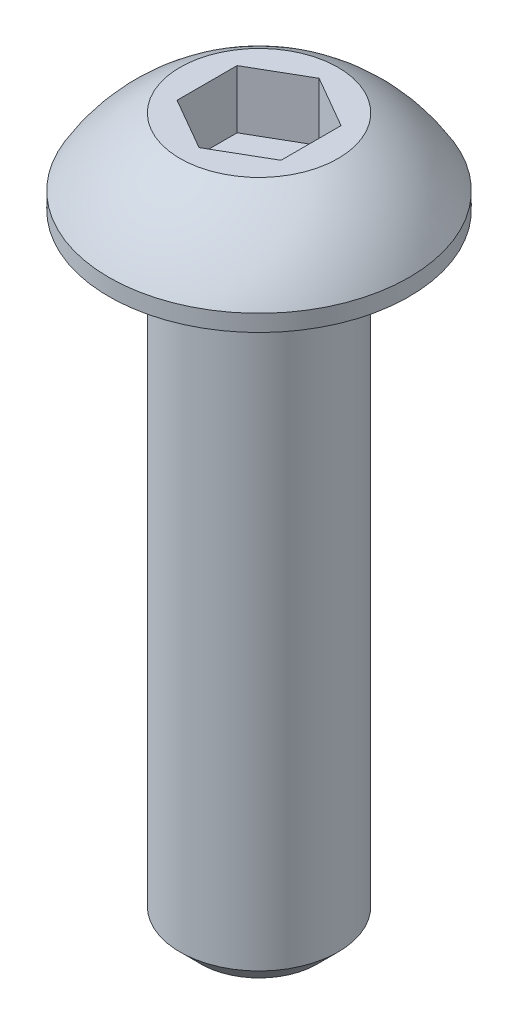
ISO-10303-21;
HEADER;
FILE_DESCRIPTION(('STEP AP214'),'2;1');
FILE_NAME('part.step','',(''),(''),'','','');
FILE_SCHEMA(('AUTOMOTIVE_DESIGN { 1 0 10303 214 1 1 1 1 }'));
ENDSEC;
DATA;
#1=APPLICATION_CONTEXT('core data for automotive mechanical design processes');
#2=APPLICATION_PROTOCOL_DEFINITION('international standard','automotive_design',2000,#1);
#3=PRODUCT_CONTEXT('',#1,'mechanical');
#4=PRODUCT('Part','Part','',(#3));
#5=PRODUCT_RELATED_PRODUCT_CATEGORY('part','',(#4));
#6=PRODUCT_DEFINITION_FORMATION('','',#4);
#7=PRODUCT_DEFINITION_CONTEXT('part definition',#1,'design');
#8=PRODUCT_DEFINITION('design','',#6,#7);
#9=PRODUCT_DEFINITION_SHAPE('','',#8);
#10=(LENGTH_UNIT() NAMED_UNIT(*) SI_UNIT(.MILLI.,.METRE.));
#11=(NAMED_UNIT(*) PLANE_ANGLE_UNIT() SI_UNIT($,.RADIAN.));
#12=(NAMED_UNIT(*) SI_UNIT($,.STERADIAN.) SOLID_ANGLE_UNIT());
#13=UNCERTAINTY_MEASURE_WITH_UNIT(LENGTH_MEASURE(1.E-05),#10,'distance_accuracy_value','');
#14=(GEOMETRIC_REPRESENTATION_CONTEXT(3) GLOBAL_UNCERTAINTY_ASSIGNED_CONTEXT((#13)) GLOBAL_UNIT_ASSIGNED_CONTEXT((#10,
#11,#12)) REPRESENTATION_CONTEXT('',''));
#15=CARTESIAN_POINT('',(0.,0.,0.));
#16=DIRECTION('',(0.,0.,1.));
#17=DIRECTION('',(1.,0.,0.));
#18=AXIS2_PLACEMENT_3D('',#15,#16,#17);
#19=CARTESIAN_POINT('',(0.,0.,0.));
#20=DIRECTION('',(0.,-1.00000000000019,0.));
#21=DIRECTION('',(0.,0.,-0.999999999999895));
#22=AXIS2_PLACEMENT_3D('',#19,#20,#21);
#23=PLANE('',#22);
#24=CARTESIAN_POINT('',(0.,0.,0.));
#25=DIRECTION('',(0.,-1.00000000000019,0.));
#26=DIRECTION('',(0.,0.,-0.999999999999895));
#27=AXIS2_PLACEMENT_3D('',#24,#25,#26);
#28=CIRCLE('',#27,2.413);
#29=CARTESIAN_POINT('',(0.,0.,-2.41299999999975));
#30=VERTEX_POINT('',#29);
#31=EDGE_CURVE('E11',#30,#30,#28,.T.);
#32=ORIENTED_EDGE('',*,*,#31,.F.);
#33=EDGE_LOOP('',(#32));
#34=FACE_BOUND('',#33,.T.);
#35=CARTESIAN_POINT('',(0.,0.,0.));
#36=DIRECTION('',(0.,-1.00000000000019,0.));
#37=DIRECTION('',(0.,0.,-0.999999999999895));
#38=AXIS2_PLACEMENT_3D('',#35,#36,#37);
#39=CIRCLE('',#38,4.5847);
#40=CARTESIAN_POINT('',(0.,0.,-4.58469999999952));
#41=VERTEX_POINT('',#40);
#42=EDGE_CURVE('E45',#41,#41,#39,.T.);
#43=ORIENTED_EDGE('',*,*,#42,.T.);
#44=EDGE_LOOP('',(#43));
#45=FACE_BOUND('',#44,.T.);
#46=ADVANCED_FACE('F38',(#34,#45),#23,.T.);
#47=CARTESIAN_POINT('',(0.,0.,0.));
#48=DIRECTION('',(0.,-1.00000000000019,0.));
#49=DIRECTION('',(0.,0.,-0.999999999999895));
#50=AXIS2_PLACEMENT_3D('',#47,#48,#49);
#51=CYLINDRICAL_SURFACE('',#50,4.5847);
#52=CARTESIAN_POINT('',(-1.9151347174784E-12,0.50800000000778,0.));
#53=DIRECTION('',(0.,-1.00000000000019,0.));
#54=DIRECTION('',(0.,0.,-0.999999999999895));
#55=AXIS2_PLACEMENT_3D('',#52,#53,#54);
#56=CIRCLE('',#55,4.5847);
#57=CARTESIAN_POINT('',(4.58470000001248,0.50800000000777,-2.55197145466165E-13));
#58=VERTEX_POINT('',#57);
#59=EDGE_CURVE('E155',#58,#58,#56,.T.);
#60=ORIENTED_EDGE('',*,*,#59,.T.);
#61=EDGE_LOOP('',(#60));
#62=FACE_BOUND('',#61,.T.);
#63=ORIENTED_EDGE('',*,*,#42,.F.);
#64=EDGE_LOOP('',(#63));
#65=FACE_BOUND('',#64,.T.);
#66=ADVANCED_FACE('F161',(#62,#65),#51,.T.);
#67=CARTESIAN_POINT('',(1.27398092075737E-11,-2.15653055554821,-1.38777878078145E-13));
#68=DIRECTION('',(0.,-1.00000000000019,0.));
#69=DIRECTION('',(0.99999999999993,0.,0.));
#70=AXIS2_PLACEMENT_3D('',#67,#68,#69);
#71=SPHERICAL_SURFACE('',#70,5.30275373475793);
#72=CARTESIAN_POINT('',(1.02418074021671E-11,2.56540000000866,2.77555756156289E-13));
#73=DIRECTION('',(0.,-1.00000000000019,0.));
#74=DIRECTION('',(0.,0.,-0.999999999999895));
#75=AXIS2_PLACEMENT_3D('',#72,#73,#74);
#76=CIRCLE('',#75,2.413);
#77=CARTESIAN_POINT('',(2.41300000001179,2.56540000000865,-2.19031174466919E-13));
#78=VERTEX_POINT('',#77);
#79=EDGE_CURVE('E152',#78,#78,#76,.T.);
#80=CARTESIAN_POINT('',(2.41300000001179,2.56540000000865,-2.19031174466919E-13));
#81=CARTESIAN_POINT('',(2.44113024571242,2.55102492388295,-2.19569817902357E-13));
#82=CARTESIAN_POINT('',(2.46913200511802,2.53639841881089,-2.20104188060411E-13));
#83=CARTESIAN_POINT('',(2.52486967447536,2.50664734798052,-2.21164213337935E-13));
#84=CARTESIAN_POINT('',(2.55260558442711,2.49152278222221,-2.21689868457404E-13));
#85=CARTESIAN_POINT('',(2.60780267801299,2.46078038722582,-2.22732295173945E-13));
#86=CARTESIAN_POINT('',(2.63526386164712,2.44516255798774,-2.23249066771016E-13));
#87=CARTESIAN_POINT('',(2.68990273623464,2.41343863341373,-2.24273561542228E-13));
#88=CARTESIAN_POINT('',(2.71708042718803,2.3973325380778,-2.24781284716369E-13));
#89=CARTESIAN_POINT('',(2.77114363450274,2.36463722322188,-2.25787520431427E-13));
#90=CARTESIAN_POINT('',(2.79802915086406,2.34804800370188,-2.26286032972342E-13));
#91=CARTESIAN_POINT('',(2.85149942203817,2.3143917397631,-2.27273688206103E-13));
#92=CARTESIAN_POINT('',(2.87808417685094,2.2973246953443,-2.27762830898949E-13));
#93=CARTESIAN_POINT('',(2.93094443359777,2.26271823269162,-2.28731590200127E-13));
#94=CARTESIAN_POINT('',(2.95721993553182,2.24517881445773,-2.29211206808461E-13));
#95=CARTESIAN_POINT('',(3.00945329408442,2.20963320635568,-2.30160760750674E-13));
#96=CARTESIAN_POINT('',(3.03541115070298,2.19162701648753,-2.30630698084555E-13));
#97=CARTESIAN_POINT('',(3.08700092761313,2.15515361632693,-2.31560743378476E-13));
#98=CARTESIAN_POINT('',(3.11263284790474,2.13668640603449,-2.32020851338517E-13));
#99=CARTESIAN_POINT('',(3.16356256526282,2.09929686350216,-2.32931090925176E-13));
#100=CARTESIAN_POINT('',(3.1888603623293,2.08037453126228,-2.33381222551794E-13));
#101=CARTESIAN_POINT('',(3.23911375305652,2.04208078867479,-2.34271365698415E-13));
#102=CARTESIAN_POINT('',(3.26406934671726,2.02270937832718,-2.34711377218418E-13));
#103=CARTESIAN_POINT('',(3.31363035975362,1.98352366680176,-2.35581139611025E-13));
#104=CARTESIAN_POINT('',(3.33823577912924,1.96370936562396,-2.36010890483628E-13));
#105=CARTESIAN_POINT('',(3.38708858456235,1.92364420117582,-2.36859994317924E-13));
#106=CARTESIAN_POINT('',(3.41133597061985,1.90339333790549,-2.37279347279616E-13));
#107=CARTESIAN_POINT('',(3.45946496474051,1.86246151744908,-2.38107521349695E-13));
#108=CARTESIAN_POINT('',(3.48334657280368,1.84178056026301,-2.38516342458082E-13));
#109=CARTESIAN_POINT('',(3.53073638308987,1.79999515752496,-2.39323322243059E-13));
#110=CARTESIAN_POINT('',(3.5542445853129,1.77889071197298,-2.39721480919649E-13));
#111=CARTESIAN_POINT('',(3.60088007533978,1.73626507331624,-2.40507008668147E-13));
#112=CARTESIAN_POINT('',(3.62400736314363,1.71474388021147,-2.40894377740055E-13));
#113=CARTESIAN_POINT('',(3.66987363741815,1.67129162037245,-2.41658202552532E-13));
#114=CARTESIAN_POINT('',(3.69261262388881,1.64936055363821,-2.420346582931E-13));
#115=CARTESIAN_POINT('',(3.73769503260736,1.60509555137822,-2.42776536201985E-13));
#116=CARTESIAN_POINT('',(3.76003845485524,1.58276161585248,-2.43141958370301E-13));
#117=CARTESIAN_POINT('',(3.80432259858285,1.53769800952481,-2.43861652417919E-13));
#118=CARTESIAN_POINT('',(3.82626332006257,1.51496833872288,-2.44215924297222E-13));
#119=CARTESIAN_POINT('',(3.86973505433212,1.46912052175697,-2.44913204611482E-13));
#120=CARTESIAN_POINT('',(3.89126606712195,1.44600237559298,-2.4525621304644E-13));
#121=CARTESIAN_POINT('',(3.93391150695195,1.39938499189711,-2.45930856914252E-13));
#122=CARTESIAN_POINT('',(3.95502593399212,1.37588575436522,-2.46262492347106E-13));
#123=CARTESIAN_POINT('',(3.99683145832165,1.32851369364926,-2.46914284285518E-13));
#124=CARTESIAN_POINT('',(4.01752255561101,1.30464087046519,-2.47234440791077E-13));
#125=CARTESIAN_POINT('',(4.05847481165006,1.25652926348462,-2.47863172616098E-13));
#126=CARTESIAN_POINT('',(4.07873597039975,1.23229047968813,-2.48171747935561E-13));
#127=CARTESIAN_POINT('',(4.11882187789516,1.18345469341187,-2.48777218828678E-13));
#128=CARTESIAN_POINT('',(4.13864662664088,1.15885769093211,-2.49074114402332E-13));
#129=CARTESIAN_POINT('',(4.17785338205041,1.10931332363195,-2.49656130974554E-13));
#130=CARTESIAN_POINT('',(4.19723538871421,1.08436595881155,-2.49941251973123E-13));
#131=CARTESIAN_POINT('',(4.23555046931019,1.03412883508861,-2.50499628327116E-13));
#132=CARTESIAN_POINT('',(4.25448354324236,1.00883907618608,-2.50772883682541E-13));
#133=CARTESIAN_POINT('',(4.29189471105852,0.957925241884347,-2.5130744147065E-13));
#134=CARTESIAN_POINT('',(4.3103728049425,0.932301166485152,-2.51568743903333E-13));
#135=CARTESIAN_POINT('',(4.34686811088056,0.880726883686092,-2.52079312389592E-13));
#136=CARTESIAN_POINT('',(4.36488532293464,0.854776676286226,-2.52328578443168E-13));
#137=CARTESIAN_POINT('',(4.40045310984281,0.802558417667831,-2.52814994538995E-13));
#138=CARTESIAN_POINT('',(4.4180036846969,0.776290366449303,-2.53052144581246E-13));
#139=CARTESIAN_POINT('',(4.45263259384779,0.723444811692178,-2.5351425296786E-13));
#140=CARTESIAN_POINT('',(4.46971092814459,0.69686730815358,-2.53739211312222E-13));
#141=CARTESIAN_POINT('',(4.50338989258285,0.643411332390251,-2.54176864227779E-13));
#142=CARTESIAN_POINT('',(4.51999052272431,0.616532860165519,-2.54389558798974E-13));
#143=CARTESIAN_POINT('',(4.55270880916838,0.562483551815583,-2.54802617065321E-13));
#144=CARTESIAN_POINT('',(4.56882646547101,0.535312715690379,-2.55002980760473E-13));
#145=CARTESIAN_POINT('',(4.58470000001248,0.50800000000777,-2.55197145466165E-13));
#146=B_SPLINE_CURVE_WITH_KNOTS('',3,(#80,#81,#82,#83,#84,#85,#86,#87,#88,#89,#90,#91,#92,#93,
#94,#95,#96,#97,#98,#99,#100,#101,#102,#103,#104,#105,#106,#107,#108,#109,#110,#111,#112,#113,
#114,#115,#116,#117,#118,#119,#120,#121,#122,#123,#124,#125,#126,#127,#128,#129,#130,#131,#132,
#133,#134,#135,#136,#137,#138,#139,#140,#141,#142,#143,#144,#145),.UNSPECIFIED.,.F.,.F.,(4,2,2,
2,2,2,2,2,2,2,2,2,2,2,2,2,2,2,2,2,2,2,2,2,2,2,2,2,2,2,2,2,4),(0.,0.094769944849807,
0.189539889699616,0.284309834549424,0.379079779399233,0.473849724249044,0.568619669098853,
0.663389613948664,0.758159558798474,0.852929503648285,0.947699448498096,1.04246939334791,
1.13723933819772,1.23200928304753,1.32677922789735,1.42154917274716,1.51631911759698,
1.61108906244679,1.7058590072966,1.80062895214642,1.89539889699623,1.99016884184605,
2.08493878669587,2.17970873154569,2.2744786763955,2.36924862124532,2.46401856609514,
2.55878851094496,2.65355845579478,2.7483284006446,2.84309834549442,2.93786829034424,
3.03263823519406),.UNSPECIFIED.);
#147=EDGE_CURVE('BSEAM163',#78,#58,#146,.T.);
#148=ORIENTED_EDGE('',*,*,#79,.T.);
#149=ORIENTED_EDGE('',*,*,#59,.F.);
#150=ORIENTED_EDGE('',*,*,#147,.T.);
#151=ORIENTED_EDGE('',*,*,#147,.F.);
#152=EDGE_LOOP('',(#148,#150,#149,#151));
#153=FACE_BOUND('',#152,.T.);
#154=ADVANCED_FACE('F163',(#153),#71,.T.);
#155=CARTESIAN_POINT('',(2.41300000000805,2.5654000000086,-3.33066907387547E-13));
#156=DIRECTION('',(0.,1.00000000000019,0.));
#157=DIRECTION('',(0.,0.,0.999999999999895));
#158=AXIS2_PLACEMENT_3D('',#155,#156,#157);
#159=PLANE('',#158);
#160=DIRECTION('',(1.0185706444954E-11,0.,0.999999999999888));
#161=VECTOR('',#160,1.);
#162=CARTESIAN_POINT('',(-1.58750000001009,2.56540000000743,-0.916543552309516));
#163=LINE('',#162,#161);
#164=CARTESIAN_POINT('',(-1.58750000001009,2.56540000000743,-0.916543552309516));
#165=VERTEX_POINT('',#164);
#166=CARTESIAN_POINT('',(-1.58749999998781,2.56540000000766,0.916543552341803));
#167=VERTEX_POINT('',#166);
#168=EDGE_CURVE('E52',#165,#167,#163,.T.);
#169=ORIENTED_EDGE('',*,*,#168,.F.);
#170=DIRECTION('',(-0.866025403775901,0.,0.500000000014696));
#171=VECTOR('',#170,1.);
#172=CARTESIAN_POINT('',(-1.78190795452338E-11,2.56540000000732,-1.83308710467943));
#173=LINE('',#172,#171);
#174=CARTESIAN_POINT('',(-1.78190795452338E-11,2.56540000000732,-1.83308710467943));
#175=VERTEX_POINT('',#174);
#176=EDGE_CURVE('E122',#175,#165,#173,.T.);
#177=ORIENTED_EDGE('',*,*,#176,.F.);
#178=DIRECTION('',(-0.866025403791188,0.,-0.499999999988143));
#179=VECTOR('',#178,1.);
#180=CARTESIAN_POINT('',(1.58749999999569,2.56540000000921,-0.916543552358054));
#181=LINE('',#180,#179);
#182=CARTESIAN_POINT('',(1.58749999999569,2.56540000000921,-0.916543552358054));
#183=VERTEX_POINT('',#182);
#184=EDGE_CURVE('E116',#183,#175,#181,.T.);
#185=ORIENTED_EDGE('',*,*,#184,.F.);
#186=DIRECTION('',(-1.01854835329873E-11,0.,-0.999999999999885));
#187=VECTOR('',#186,1.);
#188=CARTESIAN_POINT('',(1.58750000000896,2.56540000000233,0.916543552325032));
#189=LINE('',#188,#187);
#190=CARTESIAN_POINT('',(1.58750000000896,2.56540000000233,0.916543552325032));
#191=VERTEX_POINT('',#190);
#192=EDGE_CURVE('E114',#191,#183,#189,.T.);
#193=ORIENTED_EDGE('',*,*,#192,.F.);
#194=DIRECTION('',(0.866025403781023,0.,-0.500000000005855));
#195=VECTOR('',#194,1.);
#196=CARTESIAN_POINT('',(9.04831765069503E-12,2.56540000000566,1.83308710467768));
#197=LINE('',#196,#195);
#198=CARTESIAN_POINT('',(9.04831765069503E-12,2.56540000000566,1.83308710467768));
#199=VERTEX_POINT('',#198);
#200=EDGE_CURVE('E95',#199,#191,#197,.T.);
#201=ORIENTED_EDGE('',*,*,#200,.F.);
#202=DIRECTION('',(0.866025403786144,0.,0.49999999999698));
#203=VECTOR('',#202,1.);
#204=CARTESIAN_POINT('',(-1.58749999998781,2.56540000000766,0.916543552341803));
#205=LINE('',#204,#203);
#206=EDGE_CURVE('E106',#167,#199,#205,.T.);
#207=ORIENTED_EDGE('',*,*,#206,.F.);
#208=EDGE_LOOP('',(#169,#177,#185,#193,#201,#207));
#209=FACE_BOUND('',#208,.T.);
#210=ORIENTED_EDGE('',*,*,#79,.F.);
#211=EDGE_LOOP('',(#210));
#212=FACE_BOUND('',#211,.T.);
#213=ADVANCED_FACE('F110',(#209,#212),#159,.T.);
#214=CARTESIAN_POINT('',(4.9960036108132E-12,-19.0499999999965,0.));
#215=DIRECTION('',(0.,-1.00000000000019,0.));
#216=DIRECTION('',(0.,0.,-0.999999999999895));
#217=AXIS2_PLACEMENT_3D('',#214,#215,#216);
#218=PLANE('',#217);
#219=CARTESIAN_POINT('',(4.9960036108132E-12,-19.0499999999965,0.));
#220=DIRECTION('',(0.,-1.00000000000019,0.));
#221=DIRECTION('',(0.,0.,-0.999999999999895));
#222=AXIS2_PLACEMENT_3D('',#219,#220,#221);
#223=CIRCLE('',#222,1.78308);
#224=CARTESIAN_POINT('',(5.03370138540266E-12,-19.0499999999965,-1.78307999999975));
#225=VERTEX_POINT('',#224);
#226=EDGE_CURVE('E149',#225,#225,#223,.T.);
#227=ORIENTED_EDGE('',*,*,#226,.T.);
#228=EDGE_LOOP('',(#227));
#229=FACE_BOUND('',#228,.T.);
#230=ADVANCED_FACE('F175',(#229),#218,.T.);
#231=CARTESIAN_POINT('',(4.9960036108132E-12,-19.0499999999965,0.));
#232=DIRECTION('',(0.,1.00000000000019,0.));
#233=DIRECTION('',(0.,0.,0.999999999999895));
#234=AXIS2_PLACEMENT_3D('',#231,#232,#233);
#235=CONICAL_SURFACE('',#234,1.78308,0.785398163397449);
#236=CARTESIAN_POINT('',(6.02295990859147E-12,-18.4200799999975,0.));
#237=DIRECTION('',(0.,-1.00000000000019,0.));
#238=DIRECTION('',(0.,0.,-0.999999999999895));
#239=AXIS2_PLACEMENT_3D('',#236,#237,#238);
#240=CIRCLE('',#239,2.413);
#241=CARTESIAN_POINT('',(6.07397541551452E-12,-18.4200799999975,-2.41299999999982));
#242=VERTEX_POINT('',#241);
#243=EDGE_CURVE('E140',#242,#242,#240,.T.);
#244=ORIENTED_EDGE('',*,*,#243,.T.);
#245=EDGE_LOOP('',(#244));
#246=FACE_BOUND('',#245,.T.);
#247=ORIENTED_EDGE('',*,*,#226,.F.);
#248=EDGE_LOOP('',(#247));
#249=FACE_BOUND('',#248,.T.);
#250=ADVANCED_FACE('F178',(#246,#249),#235,.T.);
#251=CARTESIAN_POINT('',(0.,0.,0.));
#252=DIRECTION('',(0.,-1.00000000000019,0.));
#253=DIRECTION('',(0.,0.,-0.999999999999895));
#254=AXIS2_PLACEMENT_3D('',#251,#252,#253);
#255=CYLINDRICAL_SURFACE('',#254,2.413);
#256=ORIENTED_EDGE('',*,*,#31,.T.);
#257=EDGE_LOOP('',(#256));
#258=FACE_BOUND('',#257,.T.);
#259=ORIENTED_EDGE('',*,*,#243,.F.);
#260=EDGE_LOOP('',(#259));
#261=FACE_BOUND('',#260,.T.);
#262=ADVANCED_FACE('F182',(#258,#261),#255,.T.);
#263=CARTESIAN_POINT('',(-1.5875000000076,0.787400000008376,-0.916543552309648));
#264=DIRECTION('',(-0.999999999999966,0.,1.02291265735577E-11));
#265=DIRECTION('',(1.0185706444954E-11,0.,0.999999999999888));
#266=AXIS2_PLACEMENT_3D('',#263,#264,#265);
#267=PLANE('',#266);
#268=ORIENTED_EDGE('',*,*,#168,.T.);
#269=DIRECTION('',(0.,1.00000000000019,0.));
#270=VECTOR('',#269,1.);
#271=CARTESIAN_POINT('',(-1.58749999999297,0.787400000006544,0.91654355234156));
#272=LINE('',#271,#270);
#273=CARTESIAN_POINT('',(-1.58749999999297,0.787400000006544,0.91654355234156));
#274=VERTEX_POINT('',#273);
#275=EDGE_CURVE('E103',#274,#167,#272,.T.);
#276=ORIENTED_EDGE('',*,*,#275,.F.);
#277=DIRECTION('',(1.0185706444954E-11,0.,0.999999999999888));
#278=VECTOR('',#277,1.);
#279=CARTESIAN_POINT('',(-1.5875000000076,0.787400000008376,-0.916543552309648));
#280=LINE('',#279,#278);
#281=CARTESIAN_POINT('',(-1.5875000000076,0.787400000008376,-0.916543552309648));
#282=VERTEX_POINT('',#281);
#283=EDGE_CURVE('E124',#282,#274,#280,.T.);
#284=ORIENTED_EDGE('',*,*,#283,.F.);
#285=DIRECTION('',(0.,1.00000000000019,0.));
#286=VECTOR('',#285,1.);
#287=CARTESIAN_POINT('',(-1.5875000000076,0.787400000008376,-0.916543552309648));
#288=LINE('',#287,#286);
#289=EDGE_CURVE('E59',#282,#165,#288,.T.);
#290=ORIENTED_EDGE('',*,*,#289,.T.);
#291=EDGE_LOOP('',(#268,#276,#284,#290));
#292=FACE_BOUND('',#291,.T.);
#293=ADVANCED_FACE('F186',(#292),#267,.F.);
#294=CARTESIAN_POINT('',(-1.80133685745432E-11,0.787400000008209,-1.83308710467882));
#295=DIRECTION('',(-0.500000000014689,0.,-0.866025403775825));
#296=DIRECTION('',(-0.866025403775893,0.,0.500000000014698));
#297=AXIS2_PLACEMENT_3D('',#294,#295,#296);
#298=PLANE('',#297);
#299=ORIENTED_EDGE('',*,*,#176,.T.);
#300=ORIENTED_EDGE('',*,*,#289,.F.);
#301=DIRECTION('',(-0.866025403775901,0.,0.500000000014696));
#302=VECTOR('',#301,1.);
#303=CARTESIAN_POINT('',(-1.80133685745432E-11,0.787400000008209,-1.83308710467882));
#304=LINE('',#303,#302);
#305=CARTESIAN_POINT('',(-1.80133685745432E-11,0.787400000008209,-1.83308710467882));
#306=VERTEX_POINT('',#305);
#307=EDGE_CURVE('E136',#306,#282,#304,.T.);
#308=ORIENTED_EDGE('',*,*,#307,.F.);
#309=DIRECTION('',(0.,1.00000000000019,0.));
#310=VECTOR('',#309,1.);
#311=CARTESIAN_POINT('',(-1.80133685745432E-11,0.787400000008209,-1.83308710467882));
#312=LINE('',#311,#310);
#313=EDGE_CURVE('E141',#306,#175,#312,.T.);
#314=ORIENTED_EDGE('',*,*,#313,.T.);
#315=EDGE_LOOP('',(#299,#300,#308,#314));
#316=FACE_BOUND('',#315,.T.);
#317=ADVANCED_FACE('F190',(#316),#298,.F.);
#318=CARTESIAN_POINT('',(1.58749999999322,0.787400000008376,-0.91654355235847));
#319=DIRECTION('',(0.499999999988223,0.,-0.866025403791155));
#320=DIRECTION('',(-0.866025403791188,0.,-0.499999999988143));
#321=AXIS2_PLACEMENT_3D('',#318,#319,#320);
#322=PLANE('',#321);
#323=ORIENTED_EDGE('',*,*,#184,.T.);
#324=ORIENTED_EDGE('',*,*,#313,.F.);
#325=DIRECTION('',(-0.866025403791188,0.,-0.499999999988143));
#326=VECTOR('',#325,1.);
#327=CARTESIAN_POINT('',(1.58749999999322,0.787400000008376,-0.91654355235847));
#328=LINE('',#327,#326);
#329=CARTESIAN_POINT('',(1.58749999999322,0.787400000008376,-0.91654355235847));
#330=VERTEX_POINT('',#329);
#331=EDGE_CURVE('E133',#330,#306,#328,.T.);
#332=ORIENTED_EDGE('',*,*,#331,.F.);
#333=DIRECTION('',(0.,1.00000000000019,0.));
#334=VECTOR('',#333,1.);
#335=CARTESIAN_POINT('',(1.58749999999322,0.787400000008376,-0.91654355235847));
#336=LINE('',#335,#334);
#337=EDGE_CURVE('E143',#330,#183,#336,.T.);
#338=ORIENTED_EDGE('',*,*,#337,.T.);
#339=EDGE_LOOP('',(#323,#324,#332,#338));
#340=FACE_BOUND('',#339,.T.);
#341=ADVANCED_FACE('F199',(#340),#322,.F.);
#342=CARTESIAN_POINT('',(1.58750000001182,0.78740000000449,0.916543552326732));
#343=DIRECTION('',(0.999999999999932,0.,-1.02289661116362E-11));
#344=DIRECTION('',(-1.01854835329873E-11,0.,-0.999999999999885));
#345=AXIS2_PLACEMENT_3D('',#342,#343,#344);
#346=PLANE('',#345);
#347=ORIENTED_EDGE('',*,*,#192,.T.);
#348=ORIENTED_EDGE('',*,*,#337,.F.);
#349=DIRECTION('',(-1.01854835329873E-11,0.,-0.999999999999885));
#350=VECTOR('',#349,1.);
#351=CARTESIAN_POINT('',(1.58750000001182,0.78740000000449,0.916543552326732));
#352=LINE('',#351,#350);
#353=CARTESIAN_POINT('',(1.58750000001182,0.78740000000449,0.916543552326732));
#354=VERTEX_POINT('',#353);
#355=EDGE_CURVE('E130',#354,#330,#352,.T.);
#356=ORIENTED_EDGE('',*,*,#355,.F.);
#357=DIRECTION('',(0.,1.00000000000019,0.));
#358=VECTOR('',#357,1.);
#359=CARTESIAN_POINT('',(1.58750000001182,0.78740000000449,0.916543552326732));
#360=LINE('',#359,#358);
#361=EDGE_CURVE('E102',#354,#191,#360,.T.);
#362=ORIENTED_EDGE('',*,*,#361,.T.);
#363=EDGE_LOOP('',(#347,#348,#356,#362));
#364=FACE_BOUND('',#363,.T.);
#365=ADVANCED_FACE('F196',(#364),#346,.F.);
#366=CARTESIAN_POINT('',(9.6034291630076E-12,0.787400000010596,1.83308710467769));
#367=DIRECTION('',(0.50000000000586,0.,0.866025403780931));
#368=DIRECTION('',(0.866025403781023,0.,-0.500000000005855));
#369=AXIS2_PLACEMENT_3D('',#366,#367,#368);
#370=PLANE('',#369);
#371=ORIENTED_EDGE('',*,*,#200,.T.);
#372=ORIENTED_EDGE('',*,*,#361,.F.);
#373=DIRECTION('',(0.866025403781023,0.,-0.500000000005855));
#374=VECTOR('',#373,1.);
#375=CARTESIAN_POINT('',(9.6034291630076E-12,0.787400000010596,1.83308710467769));
#376=LINE('',#375,#374);
#377=CARTESIAN_POINT('',(9.6034291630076E-12,0.787400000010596,1.83308710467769));
#378=VERTEX_POINT('',#377);
#379=EDGE_CURVE('E98',#378,#354,#376,.T.);
#380=ORIENTED_EDGE('',*,*,#379,.F.);
#381=DIRECTION('',(0.,1.00000000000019,0.));
#382=VECTOR('',#381,1.);
#383=CARTESIAN_POINT('',(9.6034291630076E-12,0.787400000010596,1.83308710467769));
#384=LINE('',#383,#382);
#385=EDGE_CURVE('E91',#378,#199,#384,.T.);
#386=ORIENTED_EDGE('',*,*,#385,.T.);
#387=EDGE_LOOP('',(#371,#372,#380,#386));
#388=FACE_BOUND('',#387,.T.);
#389=ADVANCED_FACE('F93',(#388),#370,.F.);
#390=CARTESIAN_POINT('',(-1.58749999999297,0.787400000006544,0.91654355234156));
#391=DIRECTION('',(-0.499999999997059,0.,0.866025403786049));
#392=DIRECTION('',(0.86602540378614,0.,0.499999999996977));
#393=AXIS2_PLACEMENT_3D('',#390,#391,#392);
#394=PLANE('',#393);
#395=ORIENTED_EDGE('',*,*,#206,.T.);
#396=ORIENTED_EDGE('',*,*,#385,.F.);
#397=DIRECTION('',(0.866025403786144,0.,0.49999999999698));
#398=VECTOR('',#397,1.);
#399=CARTESIAN_POINT('',(-1.58749999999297,0.787400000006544,0.91654355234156));
#400=LINE('',#399,#398);
#401=EDGE_CURVE('E127',#274,#378,#400,.T.);
#402=ORIENTED_EDGE('',*,*,#401,.F.);
#403=ORIENTED_EDGE('',*,*,#275,.T.);
#404=EDGE_LOOP('',(#395,#396,#402,#403));
#405=FACE_BOUND('',#404,.T.);
#406=ADVANCED_FACE('F107',(#405),#394,.F.);
#407=CARTESIAN_POINT('',(-1.58749999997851,0.787400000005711,2.74963065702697));
#408=DIRECTION('',(0.,1.00000000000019,0.));
#409=DIRECTION('',(0.,0.,0.999999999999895));
#410=AXIS2_PLACEMENT_3D('',#407,#408,#409);
#411=PLANE('',#410);
#412=ORIENTED_EDGE('',*,*,#283,.T.);
#413=ORIENTED_EDGE('',*,*,#401,.T.);
#414=ORIENTED_EDGE('',*,*,#379,.T.);
#415=ORIENTED_EDGE('',*,*,#355,.T.);
#416=ORIENTED_EDGE('',*,*,#331,.T.);
#417=ORIENTED_EDGE('',*,*,#307,.T.);
#418=EDGE_LOOP('',(#412,#413,#414,#415,#416,#417));
#419=FACE_BOUND('',#418,.T.);
#420=ADVANCED_FACE('F193',(#419),#411,.T.);
#421=CLOSED_SHELL('',(#46,#66,#154,#213,#230,#250,#262,#293,#317,#341,#365,#389,#406,#420));
#422=MANIFOLD_SOLID_BREP('B2',#421);
#423=ADVANCED_BREP_SHAPE_REPRESENTATION('',(#18,#422),#14);
#424=SHAPE_DEFINITION_REPRESENTATION(#9,#423);
ENDSEC;
END-ISO-10303-21;
